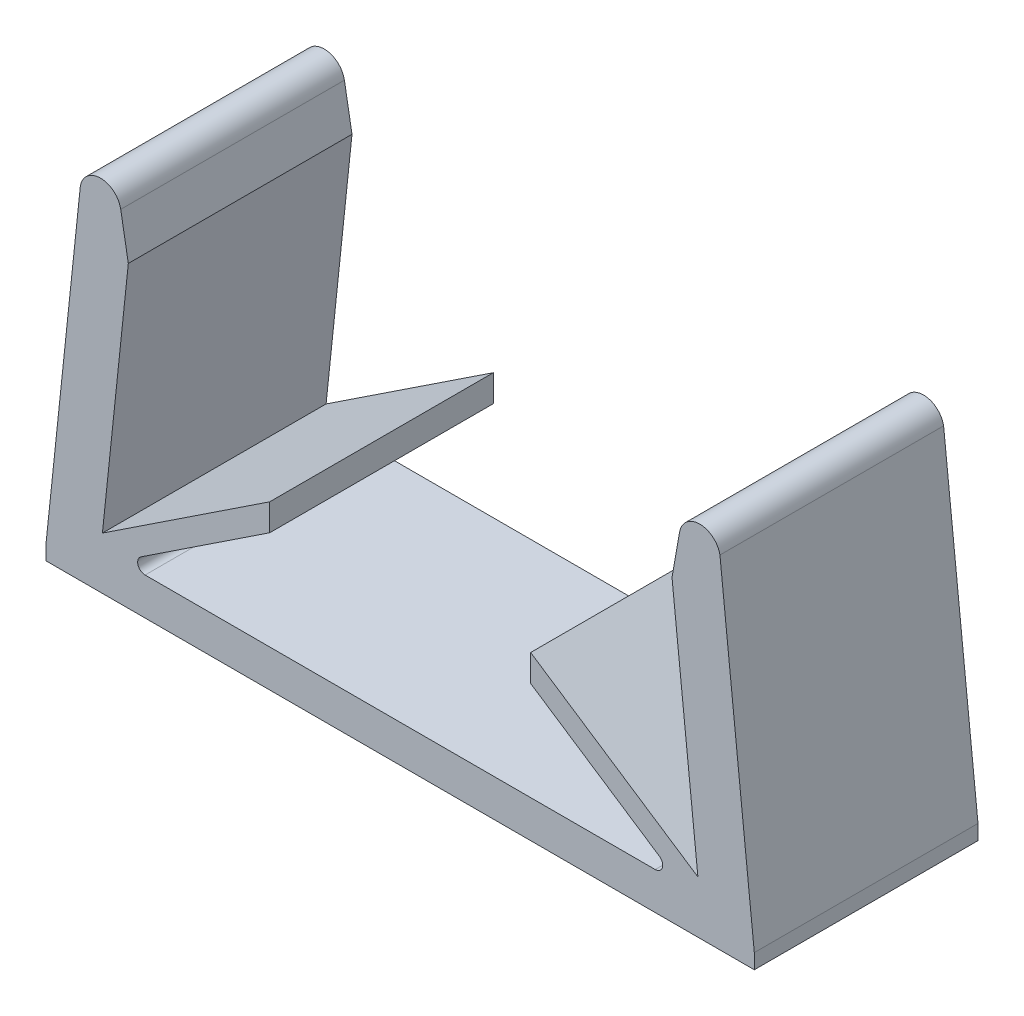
from build123d import *

# Parameters (mm, degrees)
EXTRUDE_1_DEPTH = 3


with BuildPart() as part:
    # Sketch 1 → Extrude 1 (new, symmetric)
    with BuildSketch(Plane.XY):
        with BuildLine():
            Line((7.986528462, 1.40140897), (7.291643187, 8.012800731))
            Line((7.291643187, 8.012800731), (7.495242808, 9.167471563))
            ThreePointArc((7.495242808, 9.167471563), (8.033376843, 9.621953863), (8.577268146, 9.174377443))
            Line((8.577268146, 9.174377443), (9.499492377, 0.4))
            Line((9.499492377, 0.4), (9.499492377, 0))
            Line((9.499492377, 0), (-9.499492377, 0))
            Line((-9.499492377, 0), (-9.499492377, 0.4))
            Line((-9.499492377, 0.4), (-8.577268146, 9.174377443))
            ThreePointArc((-8.577268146, 9.174377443), (-8.033376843, 9.621953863), (-7.495242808, 9.167471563))
            Line((-7.495242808, 9.167471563), (-7.291643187, 8.012800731))
            Line((-7.291643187, 8.012800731), (-7.986528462, 1.40140897))
            Line((-7.986528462, 1.40140897), (-3.5, 4.370977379))
            Line((-3.5, 4.370977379), (-3.5, 3.651454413))
            Line((-3.5, 3.651454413), (-6.951770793, 1.366777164))
            ThreePointArc((-6.951770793, 1.366777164), (-7.032897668, 1.142360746), (-6.841383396, 1))
            Line((-6.841383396, 1), (6.841383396, 1))
            ThreePointArc((6.841383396, 1), (7.032897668, 1.142360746), (6.951770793, 1.366777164))
            Line((6.951770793, 1.366777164), (3.5, 3.651454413))
            Line((3.5, 3.651454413), (3.5, 4.370977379))
            Line((3.5, 4.370977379), (7.986528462, 1.40140897))
        make_face()
    extrude(amount=EXTRUDE_1_DEPTH, both=True)


solid = part.part
